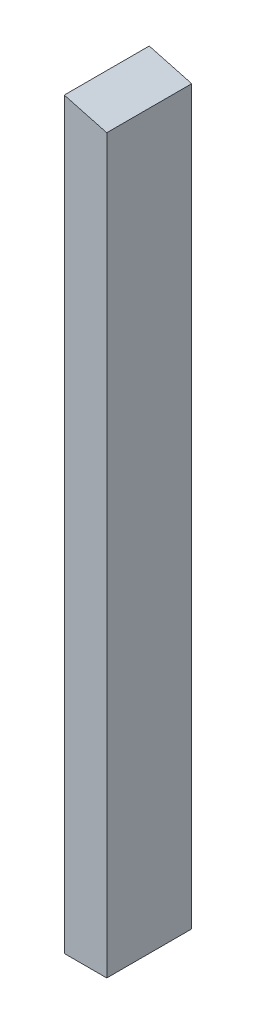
from build123d import *

# Parameters (mm, degrees)
BASE_EXTRUSION_DEPTH = 80
COQUE1_T             = -3


with BuildPart() as part:
    # Esquisse1 → Base-Extrusion (new body)
    with BuildSketch(Plane.XY):
        Polygon((3619.880972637, 3486.406605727), (3619.880972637, 2786.406605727), (3659.880972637, 2786.406605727), (3659.880972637, 3475.68863803), align=None)
    extrude(amount=-BASE_EXTRUSION_DEPTH)

    # Coque1
    coque1_openings = [part.faces().sort_by_distance(p)[0] for p in [
        (3639.880972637, 2786.406605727, -40),
    ]]
    offset(amount=COQUE1_T, openings=coque1_openings, kind=Kind.INTERSECTION)


solid = part.part
